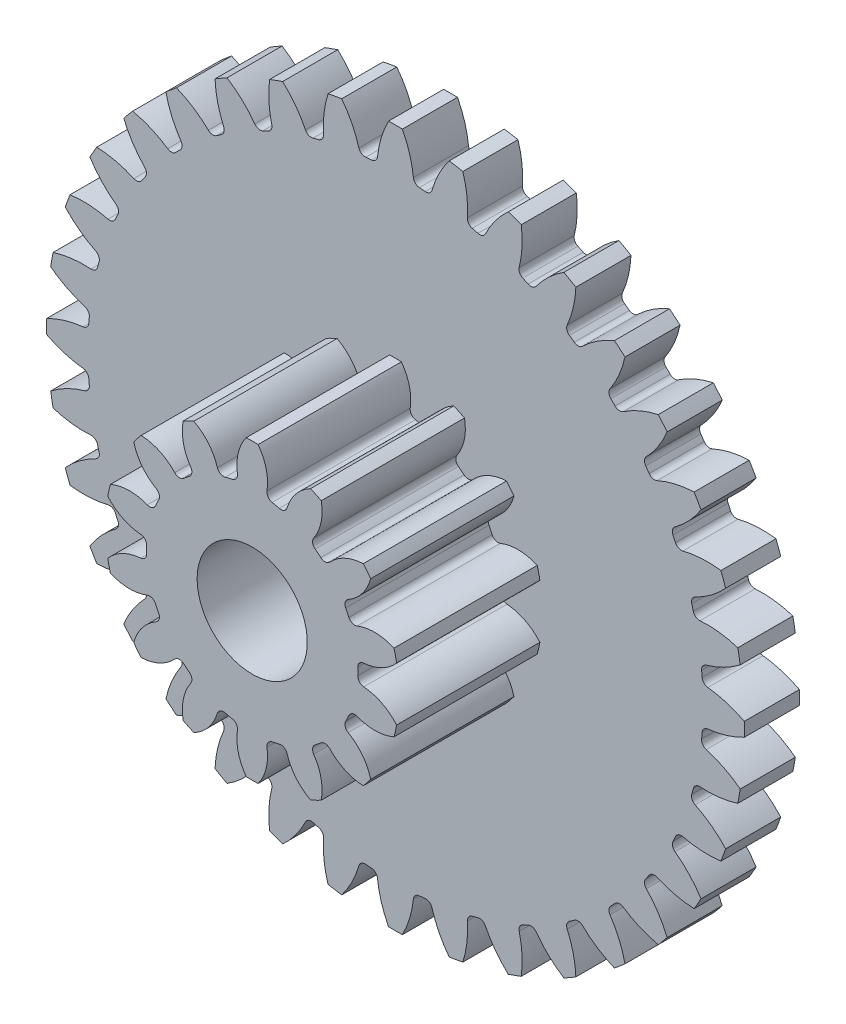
from build123d import *

# Parameters (mm, degrees)
BOSS_EXTRU_1_DEPTH                 = 1.5
CONG_1_R                           = 0.175
R_P_TITION_CIRCULAIRE4_COUNT       = 36
CONG_1_OF_R_P_TITION_CIRCULAIRE4_R = 0.175
BOSS_EXTRU_2_DEPTH                 = 3.9
CONG_2_R                           = 0.175
R_P_TITION_CIRCULAIRE5_COUNT       = 14
CONG_2_OF_R_P_TITION_CIRCULAIRE5_R = 0.175
ESQUISSE10_R                       = 1.5
ENL_V_MAT_EXTRU_4_DEPTH            = 16.770762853
EXTRUSION1_START                   = 0.5
ESQUISSE11_R                       = 2.2
ESQUISSE11_R_2                     = 1.5
EXTRUSION1_DEPTH                   = 0.5


with BuildPart() as part:
    # Esquisse3 → Boss.-Extru.1 (new body)
    with BuildSketch(Plane.XY):
        with BuildLine():
            Line((-2.108636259, 7.782778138), (-1.378706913, -0.560352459))
            Line((-1.378706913, -0.560352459), (-0.648777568, 7.782778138))
            ThreePointArc((-0.648777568, 7.782778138), (-0.76345333, 7.792017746), (-0.878245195, 7.799681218))
            ThreePointArc((-0.878245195, 7.799681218), (-0.97321156, 8.385519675), (-1.190535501, 8.937783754))
            ThreePointArc((-1.190535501, 8.937783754), (-1.378706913, 8.939647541), (-1.566878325, 8.937783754))
            ThreePointArc((-1.566878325, 8.937783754), (-1.784202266, 8.385519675), (-1.879168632, 7.799681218))
            ThreePointArc((-1.879168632, 7.799681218), (-1.993960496, 7.792017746), (-2.108636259, 7.782778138))
        make_face()
    boss_extru_1 = extrude(amount=BOSS_EXTRU_1_DEPTH)

    # Cong_1
    cong_1_edges = [part.edges().sort_by_distance(p)[0] for p in [
        (-1.879168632, 7.799681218, 0.75),
        (-0.878245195, 7.799681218, 0.75),
    ]]
    fillet(cong_1_edges, radius=CONG_1_R)

    # R_p_tition circulaire4: Boss.-Extru.1 ×36 about axis
    r_p_tition_circulaire4_axis = Axis((-1.378706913, -0.560352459, 0), (0, 0, 1))
    for i in range(1, R_P_TITION_CIRCULAIRE4_COUNT):
        add(boss_extru_1.rotate(r_p_tition_circulaire4_axis, i * 360 / R_P_TITION_CIRCULAIRE4_COUNT))

    # Cong_1 of R_p_tition circulaire4
    cong_1_of_r_p_tition_circulaire4_edges = [part.edges().sort_by_distance(p)[0] for p in [
        (-3.323270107, 7.585769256, 0.75),
        (-2.337552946, 7.759577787, 0.75),
        (-4.708287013, 7.124341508, 0.75),
        (-3.767726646, 7.466677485, 0.75),
        (-5.992136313, 6.429418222, 0.75),
        (-5.12531119, 6.929879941, 0.75),
        (-7.135808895, 5.522114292, 0.75),
        (-6.369057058, 6.165495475, 0.75),
        (-8.104554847, 4.429997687, 0.75),
        (-7.461173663, 5.196749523, 0.75),
        (-8.868939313, 3.186251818, 0.75),
        (-8.368477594, 4.053076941, 0.75),
        (-9.405736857, 1.828667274, 0.75),
        (-9.06340088, 2.769227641, 0.75),
        (-9.698637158, 0.398493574, 0.75),
        (-9.524828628, 1.384210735, 0.75),
        (-9.738740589, -1.060814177, 0.75),
        (-9.738740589, -0.05989074, 0.75),
        (-9.524828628, -2.504915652, 0.75),
        (-9.698637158, -1.519198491, 0.75),
        (-9.06340088, -3.889932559, 0.75),
        (-9.405736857, -2.949372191, 0.75),
        (-8.368477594, -5.173781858, 0.75),
        (-8.868939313, -4.306956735, 0.75),
        (-7.461173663, -6.317454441, 0.75),
        (-8.104554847, -5.550702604, 0.75),
        (-6.369057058, -7.286200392, 0.75),
        (-7.135808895, -6.642819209, 0.75),
        (-5.12531119, -8.050584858, 0.75),
        (-5.992136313, -7.55012314, 0.75),
        (-3.767726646, -8.587382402, 0.75),
        (-4.708287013, -8.245046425, 0.75),
        (-2.337552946, -8.880282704, 0.75),
        (-3.323270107, -8.706474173, 0.75),
        (-0.878245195, -8.920386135, 0.75),
        (-1.879168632, -8.920386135, 0.75),
        (0.56585628, -8.706474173, 0.75),
        (-0.41986088, -8.880282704, 0.75),
        (1.950873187, -8.245046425, 0.75),
        (1.010312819, -8.587382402, 0.75),
        (3.234722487, -7.55012314, 0.75),
        (2.367897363, -8.050584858, 0.75),
        (4.378395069, -6.642819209, 0.75),
        (3.611643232, -7.286200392, 0.75),
        (5.347141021, -5.550702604, 0.75),
        (4.703759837, -6.317454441, 0.75),
        (6.111525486, -4.306956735, 0.75),
        (5.611063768, -5.173781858, 0.75),
        (6.648323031, -2.949372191, 0.75),
        (6.305987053, -3.889932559, 0.75),
        (6.941223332, -1.519198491, 0.75),
        (6.767414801, -2.504915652, 0.75),
        (6.981326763, -0.05989074, 0.75),
        (6.981326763, -1.060814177, 0.75),
        (6.767414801, 1.384210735, 0.75),
        (6.941223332, 0.398493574, 0.75),
        (6.305987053, 2.769227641, 0.75),
        (6.648323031, 1.828667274, 0.75),
        (5.611063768, 4.053076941, 0.75),
        (6.111525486, 3.186251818, 0.75),
        (4.703759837, 5.196749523, 0.75),
        (5.347141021, 4.429997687, 0.75),
        (3.611643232, 6.165495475, 0.75),
        (4.378395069, 5.522114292, 0.75),
        (2.367897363, 6.929879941, 0.75),
        (3.234722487, 6.429418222, 0.75),
        (1.010312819, 7.466677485, 0.75),
        (1.950873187, 7.124341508, 0.75),
        (-0.41986088, 7.759577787, 0.75),
        (0.56585628, 7.585769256, 0.75),
    ]]
    fillet(cong_1_of_r_p_tition_circulaire4_edges, radius=CONG_1_OF_R_P_TITION_CIRCULAIRE4_R)

    # Esquisse8 → Boss.-Extru.2 (add)
    with BuildSketch(Plane.XY.offset(1.5)):
        with BuildLine():
            Line((-2.018454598, 2.242565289), (-1.378706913, -0.560352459))
            Line((-1.378706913, -0.560352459), (-0.738959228, 2.242565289))
            ThreePointArc((-0.738959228, 2.242565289), (-0.875967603, 2.270350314), (-1.014164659, 2.291442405))
            ThreePointArc((-1.014164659, 2.291442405), (-0.981175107, 2.887779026), (-1.217255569, 3.436387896))
            ThreePointArc((-1.217255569, 3.436387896), (-1.378706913, 3.439647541), (-1.540158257, 3.436387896))
            ThreePointArc((-1.540158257, 3.436387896), (-1.776238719, 2.887779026), (-1.743249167, 2.291442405))
            ThreePointArc((-1.743249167, 2.291442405), (-1.881446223, 2.270350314), (-2.018454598, 2.242565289))
        make_face()
    boss_extru_2 = extrude(amount=BOSS_EXTRU_2_DEPTH)

    # Cong_2
    cong_2_edges = [part.edges().sort_by_distance(p)[0] for p in [
        (-1.014164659, 2.291442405, 3.45),
        (-1.743249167, 2.291442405, 3.45),
    ]]
    fillet(cong_2_edges, radius=CONG_2_R)

    # R_p_tition circulaire5: Boss.-Extru.2 ×14 about axis
    r_p_tition_circulaire5_axis = Axis((-1.378706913, -0.560352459, 0), (0, 0, 1))
    for i in range(1, R_P_TITION_CIRCULAIRE5_COUNT):
        add(boss_extru_2.rotate(r_p_tition_circulaire5_axis, i * 360 / R_P_TITION_CIRCULAIRE5_COUNT))

    # Cong_2 of R_p_tition circulaire5
    cong_2_of_r_p_tition_circulaire5_edges = [part.edges().sort_by_distance(p)[0] for p in [
        (-2.28761311, 2.167194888, 3.45),
        (-2.944495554, 1.850856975, 3.45),
        (-3.381041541, 1.502723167, 3.45),
        (-3.835618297, 0.932701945, 3.45),
        (-4.077883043, 0.429634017, 3.45),
        (-4.240119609, -0.281170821, 3.45),
        (-4.240119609, -0.839534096, 3.45),
        (-4.077883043, -1.550338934, 3.45),
        (-3.835618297, -2.053406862, 3.45),
        (-3.381041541, -2.623428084, 3.45),
        (-2.944495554, -2.971561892, 3.45),
        (-2.28761311, -3.287899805, 3.45),
        (-1.743249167, -3.412147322, 3.45),
        (-1.014164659, -3.412147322, 3.45),
        (-0.469800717, -3.287899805, 3.45),
        (0.187081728, -2.971561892, 3.45),
        (0.623627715, -2.623428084, 3.45),
        (1.078204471, -2.053406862, 3.45),
        (1.320469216, -1.550338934, 3.45),
        (1.482705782, -0.839534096, 3.45),
        (1.482705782, -0.281170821, 3.45),
        (1.320469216, 0.429634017, 3.45),
        (1.078204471, 0.932701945, 3.45),
        (0.623627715, 1.502723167, 3.45),
        (0.187081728, 1.850856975, 3.45),
        (-0.469800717, 2.167194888, 3.45),
    ]]
    fillet(cong_2_of_r_p_tition_circulaire5_edges, radius=CONG_2_OF_R_P_TITION_CIRCULAIRE5_R)

    # Esquisse10 → Enl_v. mat.-Extru.4 (cut, through all)
    with BuildSketch(Plane.XY):
        with Locations(Location((-1.378706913, -0.560352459, 0), (0, 0, 180))):
            Circle(ESQUISSE10_R)
    extrude(amount=ENL_V_MAT_EXTRU_4_DEPTH, mode=Mode.SUBTRACT)

    # Esquisse11 → Extrusion1 (add)
    with BuildSketch(Plane(origin=(0, 0, 0), x_dir=(-1, 0, 0), z_dir=(0, 0, -1)).offset(EXTRUSION1_START)):
        with Locations(Location((1.378706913, -0.560352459, 0), (0, 0, 180))):
            Circle(ESQUISSE11_R)
        with Locations((1.378706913, -0.560352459)):
            Circle(ESQUISSE11_R_2, mode=Mode.SUBTRACT)
    extrude(amount=-EXTRUSION1_DEPTH)


solid = part.part
